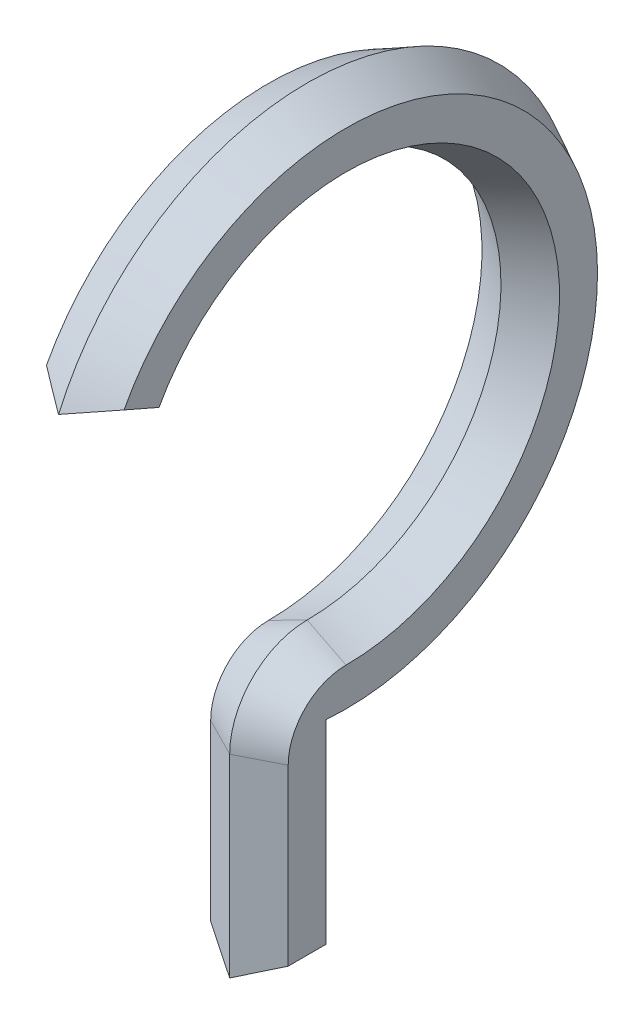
ISO-10303-21;
HEADER;
FILE_DESCRIPTION(('STEP AP214'),'2;1');
FILE_NAME('part.step','',(''),(''),'','','');
FILE_SCHEMA(('AUTOMOTIVE_DESIGN { 1 0 10303 214 1 1 1 1 }'));
ENDSEC;
DATA;
#1=APPLICATION_CONTEXT('core data for automotive mechanical design processes');
#2=APPLICATION_PROTOCOL_DEFINITION('international standard','automotive_design',2000,#1);
#3=PRODUCT_CONTEXT('',#1,'mechanical');
#4=PRODUCT('Part','Part','',(#3));
#5=PRODUCT_RELATED_PRODUCT_CATEGORY('part','',(#4));
#6=PRODUCT_DEFINITION_FORMATION('','',#4);
#7=PRODUCT_DEFINITION_CONTEXT('part definition',#1,'design');
#8=PRODUCT_DEFINITION('design','',#6,#7);
#9=PRODUCT_DEFINITION_SHAPE('','',#8);
#10=(LENGTH_UNIT() NAMED_UNIT(*) SI_UNIT(.MILLI.,.METRE.));
#11=(NAMED_UNIT(*) PLANE_ANGLE_UNIT() SI_UNIT($,.RADIAN.));
#12=(NAMED_UNIT(*) SI_UNIT($,.STERADIAN.) SOLID_ANGLE_UNIT());
#13=UNCERTAINTY_MEASURE_WITH_UNIT(LENGTH_MEASURE(1.E-05),#10,'distance_accuracy_value','');
#14=(GEOMETRIC_REPRESENTATION_CONTEXT(3) GLOBAL_UNCERTAINTY_ASSIGNED_CONTEXT((#13)) GLOBAL_UNIT_ASSIGNED_CONTEXT((#10,
#11,#12)) REPRESENTATION_CONTEXT('',''));
#15=CARTESIAN_POINT('',(0.,0.,0.));
#16=DIRECTION('',(0.,0.,1.));
#17=DIRECTION('',(1.,0.,0.));
#18=AXIS2_PLACEMENT_3D('',#15,#16,#17);
#19=CARTESIAN_POINT('',(0.,60.,-10.));
#20=DIRECTION('',(-1.,0.,0.));
#21=DIRECTION('',(0.,0.,-1.));
#22=AXIS2_PLACEMENT_3D('',#19,#20,#21);
#23=CONICAL_SURFACE('',#22,35.,0.47123889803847);
#24=CARTESIAN_POINT('',(0.,60.,-10.));
#25=DIRECTION('',(1.,0.,0.));
#26=DIRECTION('',(0.,0.,-1.));
#27=AXIS2_PLACEMENT_3D('',#24,#25,#26);
#28=CIRCLE('',#27,35.);
#29=CARTESIAN_POINT('',(0.,25.,-10.));
#30=VERTEX_POINT('',#29);
#31=CARTESIAN_POINT('',(0.,74.,22.0780298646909));
#32=VERTEX_POINT('',#31);
#33=EDGE_CURVE('E116',#30,#32,#28,.T.);
#34=ORIENTED_EDGE('',*,*,#33,.T.);
#35=CARTESIAN_POINT('',(5.,75.2758266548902,18.6322478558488));
#36=CARTESIAN_POINT('',(4.58643505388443,75.1738828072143,18.9254698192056));
#37=CARTESIAN_POINT('',(4.17202409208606,75.0707690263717,19.2170887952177));
#38=CARTESIAN_POINT('',(3.34163659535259,74.8623221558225,19.7972359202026));
#39=CARTESIAN_POINT('',(2.92566015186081,74.7569891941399,20.0857642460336));
#40=CARTESIAN_POINT('',(2.09222292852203,74.5442133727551,20.6598772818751));
#41=CARTESIAN_POINT('',(1.67476215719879,74.4367705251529,20.9454620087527));
#42=CARTESIAN_POINT('',(0.838419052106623,74.2198697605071,21.5138251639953));
#43=CARTESIAN_POINT('',(0.41953663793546,74.1104117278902,21.796603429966));
#44=CARTESIAN_POINT('',(0.,74.,22.0780298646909));
#45=B_SPLINE_CURVE_WITH_KNOTS('',3,(#35,#36,#37,#38,#39,#40,#41,#42,#43,#44),.UNSPECIFIED.,.F.,
.F.,(4,2,2,2,4),(0.,1.55133720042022,3.10258514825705,4.65382420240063,6.20515250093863),.UNSPECIFIED.);
#46=CARTESIAN_POINT('',(5.,75.2758266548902,18.6322478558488));
#47=VERTEX_POINT('',#46);
#48=EDGE_CURVE('E11',#47,#32,#45,.T.);
#49=ORIENTED_EDGE('',*,*,#48,.F.);
#50=CARTESIAN_POINT('',(5.,60.,-10.));
#51=DIRECTION('',(1.,0.,0.));
#52=DIRECTION('',(0.,0.,-1.));
#53=AXIS2_PLACEMENT_3D('',#50,#51,#52);
#54=CIRCLE('',#53,32.4523727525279);
#55=CARTESIAN_POINT('',(5.,27.6477807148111,-7.45237275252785));
#56=VERTEX_POINT('',#55);
#57=EDGE_CURVE('E162',#56,#47,#54,.T.);
#58=ORIENTED_EDGE('',*,*,#57,.F.);
#59=CARTESIAN_POINT('',(5.,27.6477807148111,-7.45237275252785));
#60=CARTESIAN_POINT('',(4.58643505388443,27.4198158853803,-7.66309461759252));
#61=CARTESIAN_POINT('',(4.17202409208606,27.193788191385,-7.87424754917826));
#62=CARTESIAN_POINT('',(3.34163659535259,26.7454533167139,-8.29735111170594));
#63=CARTESIAN_POINT('',(2.92566015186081,26.523145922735,-8.50930169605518));
#64=CARTESIAN_POINT('',(2.09222292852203,26.082072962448,-8.93395917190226));
#65=CARTESIAN_POINT('',(1.67476215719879,25.863307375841,-9.14666605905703));
#66=CARTESIAN_POINT('',(0.838419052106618,25.4291542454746,-9.57280415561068));
#67=CARTESIAN_POINT('',(0.419536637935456,25.2137668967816,-9.78623540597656));
#68=CARTESIAN_POINT('',(0.,25.,-10.));
#69=B_SPLINE_CURVE_WITH_KNOTS('',3,(#59,#60,#61,#62,#63,#64,#65,#66,#67,#68),.UNSPECIFIED.,.F.,
.F.,(4,2,2,2,4),(0.,1.55133720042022,3.10258514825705,4.65382420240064,6.20515250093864),.UNSPECIFIED.);
#70=EDGE_CURVE('E119',#56,#30,#69,.T.);
#71=ORIENTED_EDGE('',*,*,#70,.T.);
#72=EDGE_LOOP('',(#34,#49,#58,#71));
#73=FACE_BOUND('',#72,.T.);
#74=ADVANCED_FACE('F33',(#73),#23,.T.);
#75=CARTESIAN_POINT('',(0.,70.,12.9128784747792));
#76=DIRECTION('',(0.453990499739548,-0.816620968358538,0.356402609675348));
#77=DIRECTION('',(0.874015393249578,0.485898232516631,0.));
#78=AXIS2_PLACEMENT_3D('',#75,#76,#77);
#79=PLANE('',#78);
#80=DIRECTION('',(0.,0.400000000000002,0.916515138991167));
#81=VECTOR('',#80,1.);
#82=CARTESIAN_POINT('',(0.,70.,12.9128784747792));
#83=LINE('',#82,#81);
#84=CARTESIAN_POINT('',(0.,70.,12.9128784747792));
#85=VERTEX_POINT('',#84);
#86=EDGE_CURVE('E123',#85,#32,#83,.T.);
#87=ORIENTED_EDGE('',*,*,#86,.F.);
#88=CARTESIAN_POINT('',(5.,73.3067673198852,14.1205661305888));
#89=CARTESIAN_POINT('',(4.58042440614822,73.0328897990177,14.0274950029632));
#90=CARTESIAN_POINT('',(4.16149859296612,72.7586087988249,13.9326716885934));
#91=CARTESIAN_POINT('',(3.3250851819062,72.2092292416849,13.7393197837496));
#92=CARTESIAN_POINT('',(2.90759748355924,71.9341307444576,13.6407914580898));
#93=CARTESIAN_POINT('',(2.07413530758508,71.3830640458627,13.4398145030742));
#94=CARTESIAN_POINT('',(1.65816084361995,71.1070958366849,13.3373658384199));
#95=CARTESIAN_POINT('',(0.827828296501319,70.5542403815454,13.1283037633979));
#96=CARTESIAN_POINT('',(0.413470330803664,70.2773530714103,13.0216900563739));
#97=CARTESIAN_POINT('',(0.,70.,12.9128784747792));
#98=B_SPLINE_CURVE_WITH_KNOTS('',3,(#88,#89,#90,#91,#92,#93,#94,#95,#96,#97),.UNSPECIFIED.,.F.,
.F.,(4,2,2,2,4),(0.,1.528865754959,3.05762244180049,4.58639289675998,6.11527243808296),.UNSPECIFIED.);
#99=CARTESIAN_POINT('',(5.,73.3067673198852,14.1205661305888));
#100=VERTEX_POINT('',#99);
#101=EDGE_CURVE('E42',#100,#85,#98,.T.);
#102=ORIENTED_EDGE('',*,*,#101,.F.);
#103=DIRECTION('',(0.,0.400000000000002,0.916515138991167));
#104=VECTOR('',#103,1.);
#105=CARTESIAN_POINT('',(5.,72.3349389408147,11.8938275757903));
#106=LINE('',#105,#104);
#107=EDGE_CURVE('E132',#100,#47,#106,.T.);
#108=ORIENTED_EDGE('',*,*,#107,.T.);
#109=ORIENTED_EDGE('',*,*,#48,.T.);
#110=EDGE_LOOP('',(#87,#102,#108,#109));
#111=FACE_BOUND('',#110,.T.);
#112=ADVANCED_FACE('F128',(#111),#79,.T.);
#113=CARTESIAN_POINT('',(0.,60.,-10.));
#114=DIRECTION('',(1.,0.,0.));
#115=DIRECTION('',(0.,0.,-1.));
#116=AXIS2_PLACEMENT_3D('',#113,#114,#115);
#117=CONICAL_SURFACE('',#116,25.,0.47123889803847);
#118=CARTESIAN_POINT('',(0.,60.,-10.));
#119=DIRECTION('',(1.,0.,0.));
#120=DIRECTION('',(0.,0.,-1.));
#121=AXIS2_PLACEMENT_3D('',#118,#119,#120);
#122=CIRCLE('',#121,25.);
#123=CARTESIAN_POINT('',(0.,35.,-10.));
#124=VERTEX_POINT('',#123);
#125=EDGE_CURVE('E147',#124,#85,#122,.T.);
#126=ORIENTED_EDGE('',*,*,#125,.F.);
#127=DIRECTION('',(-0.891006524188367,0.453990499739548,0.));
#128=VECTOR('',#127,1.);
#129=CARTESIAN_POINT('',(0.,35.,-10.));
#130=LINE('',#129,#128);
#131=CARTESIAN_POINT('',(5.,32.4523727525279,-10.));
#132=VERTEX_POINT('',#131);
#133=EDGE_CURVE('E189',#132,#124,#130,.T.);
#134=ORIENTED_EDGE('',*,*,#133,.F.);
#135=CARTESIAN_POINT('',(5.,60.,-10.));
#136=DIRECTION('',(1.,0.,0.));
#137=DIRECTION('',(0.,0.,-1.));
#138=AXIS2_PLACEMENT_3D('',#135,#136,#137);
#139=CIRCLE('',#138,27.5476272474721);
#140=EDGE_CURVE('E397',#132,#100,#139,.T.);
#141=ORIENTED_EDGE('',*,*,#140,.T.);
#142=ORIENTED_EDGE('',*,*,#101,.T.);
#143=EDGE_LOOP('',(#126,#134,#141,#142));
#144=FACE_BOUND('',#143,.T.);
#145=ADVANCED_FACE('F178',(#144),#117,.F.);
#146=CARTESIAN_POINT('',(0.,25.,-10.));
#147=DIRECTION('',(-1.,0.,0.));
#148=DIRECTION('',(0.,0.,1.));
#149=AXIS2_PLACEMENT_3D('',#146,#147,#148);
#150=CONICAL_SURFACE('',#149,10.,0.47123889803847);
#151=CARTESIAN_POINT('',(0.,25.,-10.));
#152=DIRECTION('',(-1.,0.,0.));
#153=DIRECTION('',(0.,0.,1.));
#154=AXIS2_PLACEMENT_3D('',#151,#152,#153);
#155=CIRCLE('',#154,10.);
#156=CARTESIAN_POINT('',(0.,25.,0.));
#157=VERTEX_POINT('',#156);
#158=EDGE_CURVE('E149',#157,#124,#155,.T.);
#159=ORIENTED_EDGE('',*,*,#158,.F.);
#160=DIRECTION('',(-0.891006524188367,0.,0.453990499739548));
#161=VECTOR('',#160,1.);
#162=CARTESIAN_POINT('',(0.,25.,0.));
#163=LINE('',#162,#161);
#164=CARTESIAN_POINT('',(5.,25.,-2.54762724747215));
#165=VERTEX_POINT('',#164);
#166=EDGE_CURVE('E381',#165,#157,#163,.T.);
#167=ORIENTED_EDGE('',*,*,#166,.F.);
#168=CARTESIAN_POINT('',(5.,25.,-10.));
#169=DIRECTION('',(1.,0.,0.));
#170=DIRECTION('',(0.,0.,-1.));
#171=AXIS2_PLACEMENT_3D('',#168,#169,#170);
#172=CIRCLE('',#171,7.45237275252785);
#173=EDGE_CURVE('E393',#165,#132,#172,.F.);
#174=ORIENTED_EDGE('',*,*,#173,.T.);
#175=ORIENTED_EDGE('',*,*,#133,.T.);
#176=EDGE_LOOP('',(#159,#167,#174,#175));
#177=FACE_BOUND('',#176,.T.);
#178=ADVANCED_FACE('F35',(#177),#150,.T.);
#179=CARTESIAN_POINT('',(0.,0.,0.));
#180=DIRECTION('',(0.453990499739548,0.,0.891006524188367));
#181=DIRECTION('',(0.891006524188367,0.,-0.453990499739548));
#182=AXIS2_PLACEMENT_3D('',#179,#180,#181);
#183=PLANE('',#182);
#184=DIRECTION('',(0.,1.,0.));
#185=VECTOR('',#184,1.);
#186=CARTESIAN_POINT('',(0.,0.,0.));
#187=LINE('',#186,#185);
#188=CARTESIAN_POINT('',(0.,0.,0.));
#189=VERTEX_POINT('',#188);
#190=EDGE_CURVE('E155',#189,#157,#187,.T.);
#191=ORIENTED_EDGE('',*,*,#190,.F.);
#192=DIRECTION('',(-0.811311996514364,-0.413384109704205,0.413384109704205));
#193=VECTOR('',#192,1.);
#194=CARTESIAN_POINT('',(3.35383487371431,1.70886422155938,-1.70886422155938));
#195=LINE('',#194,#193);
#196=CARTESIAN_POINT('',(5.,2.54762724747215,-2.54762724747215));
#197=VERTEX_POINT('',#196);
#198=EDGE_CURVE('E386',#197,#189,#195,.T.);
#199=ORIENTED_EDGE('',*,*,#198,.F.);
#200=DIRECTION('',(0.,1.,0.));
#201=VECTOR('',#200,1.);
#202=CARTESIAN_POINT('',(5.,0.,-2.54762724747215));
#203=LINE('',#202,#201);
#204=EDGE_CURVE('E392',#197,#165,#203,.T.);
#205=ORIENTED_EDGE('',*,*,#204,.T.);
#206=ORIENTED_EDGE('',*,*,#166,.T.);
#207=EDGE_LOOP('',(#191,#199,#205,#206));
#208=FACE_BOUND('',#207,.T.);
#209=ADVANCED_FACE('F198',(#208),#183,.T.);
#210=CARTESIAN_POINT('',(0.,0.,-10.));
#211=DIRECTION('',(0.453990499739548,-0.891006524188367,0.));
#212=DIRECTION('',(0.891006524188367,0.453990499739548,0.));
#213=AXIS2_PLACEMENT_3D('',#210,#211,#212);
#214=PLANE('',#213);
#215=DIRECTION('',(0.,0.,1.));
#216=VECTOR('',#215,1.);
#217=CARTESIAN_POINT('',(0.,0.,-10.));
#218=LINE('',#217,#216);
#219=CARTESIAN_POINT('',(0.,0.,-10.));
#220=VERTEX_POINT('',#219);
#221=EDGE_CURVE('E158',#220,#189,#218,.T.);
#222=ORIENTED_EDGE('',*,*,#221,.F.);
#223=DIRECTION('',(0.811311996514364,0.413384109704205,0.413384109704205));
#224=VECTOR('',#223,1.);
#225=CARTESIAN_POINT('',(0.,0.,-10.));
#226=LINE('',#225,#224);
#227=CARTESIAN_POINT('',(5.,2.54762724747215,-7.45237275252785));
#228=VERTEX_POINT('',#227);
#229=EDGE_CURVE('E57',#228,#220,#226,.F.);
#230=ORIENTED_EDGE('',*,*,#229,.F.);
#231=DIRECTION('',(0.,0.,1.));
#232=VECTOR('',#231,1.);
#233=CARTESIAN_POINT('',(5.,2.54762724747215,-10.));
#234=LINE('',#233,#232);
#235=EDGE_CURVE('E390',#228,#197,#234,.T.);
#236=ORIENTED_EDGE('',*,*,#235,.T.);
#237=ORIENTED_EDGE('',*,*,#198,.T.);
#238=EDGE_LOOP('',(#222,#230,#236,#237));
#239=FACE_BOUND('',#238,.T.);
#240=ADVANCED_FACE('F196',(#239),#214,.T.);
#241=CARTESIAN_POINT('',(0.,0.,-10.));
#242=DIRECTION('',(0.453990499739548,0.,-0.891006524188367));
#243=DIRECTION('',(-0.891006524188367,0.,-0.453990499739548));
#244=AXIS2_PLACEMENT_3D('',#241,#242,#243);
#245=PLANE('',#244);
#246=DIRECTION('',(0.,1.,0.));
#247=VECTOR('',#246,1.);
#248=CARTESIAN_POINT('',(0.,0.,-10.));
#249=LINE('',#248,#247);
#250=EDGE_CURVE('E161',#220,#30,#249,.T.);
#251=ORIENTED_EDGE('',*,*,#250,.T.);
#252=ORIENTED_EDGE('',*,*,#70,.F.);
#253=DIRECTION('',(0.,-1.,0.));
#254=VECTOR('',#253,1.);
#255=CARTESIAN_POINT('',(5.,0.,-7.45237275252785));
#256=LINE('',#255,#254);
#257=EDGE_CURVE('E37',#228,#56,#256,.F.);
#258=ORIENTED_EDGE('',*,*,#257,.F.);
#259=ORIENTED_EDGE('',*,*,#229,.T.);
#260=EDGE_LOOP('',(#251,#252,#258,#259));
#261=FACE_BOUND('',#260,.T.);
#262=ADVANCED_FACE('F179',(#261),#245,.T.);
#263=CARTESIAN_POINT('',(5.,60.,-10.));
#264=DIRECTION('',(1.,0.,0.));
#265=DIRECTION('',(0.,0.,-1.));
#266=AXIS2_PLACEMENT_3D('',#263,#264,#265);
#267=PLANE('',#266);
#268=ORIENTED_EDGE('',*,*,#57,.T.);
#269=ORIENTED_EDGE('',*,*,#107,.F.);
#270=ORIENTED_EDGE('',*,*,#140,.F.);
#271=ORIENTED_EDGE('',*,*,#173,.F.);
#272=ORIENTED_EDGE('',*,*,#204,.F.);
#273=ORIENTED_EDGE('',*,*,#235,.F.);
#274=ORIENTED_EDGE('',*,*,#257,.T.);
#275=EDGE_LOOP('',(#268,#269,#270,#271,#272,#273,#274));
#276=FACE_BOUND('',#275,.T.);
#277=ADVANCED_FACE('F240',(#276),#267,.T.);
#278=CARTESIAN_POINT('',(0.,60.,-10.));
#279=DIRECTION('',(1.,0.,0.));
#280=DIRECTION('',(0.,0.,-1.));
#281=AXIS2_PLACEMENT_3D('',#278,#279,#280);
#282=CONICAL_SURFACE('',#281,35.,0.47123889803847);
#283=ORIENTED_EDGE('',*,*,#33,.F.);
#284=CARTESIAN_POINT('',(-5.,27.6477807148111,-7.45237275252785));
#285=CARTESIAN_POINT('',(-4.58643505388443,27.4198158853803,-7.66309461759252));
#286=CARTESIAN_POINT('',(-4.17202409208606,27.193788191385,-7.87424754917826));
#287=CARTESIAN_POINT('',(-3.34163659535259,26.7454533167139,-8.29735111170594));
#288=CARTESIAN_POINT('',(-2.92566015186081,26.523145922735,-8.50930169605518));
#289=CARTESIAN_POINT('',(-2.09222292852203,26.082072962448,-8.93395917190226));
#290=CARTESIAN_POINT('',(-1.67476215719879,25.863307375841,-9.14666605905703));
#291=CARTESIAN_POINT('',(-0.838419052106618,25.4291542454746,-9.57280415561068));
#292=CARTESIAN_POINT('',(-0.419536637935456,25.2137668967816,-9.78623540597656));
#293=CARTESIAN_POINT('',(0.,25.,-10.));
#294=B_SPLINE_CURVE_WITH_KNOTS('',3,(#284,#285,#286,#287,#288,#289,#290,#291,#292,#293),
.UNSPECIFIED.,.F.,.F.,(4,2,2,2,4),(0.,1.55133720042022,3.10258514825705,4.65382420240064,
6.20515250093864),.UNSPECIFIED.);
#295=CARTESIAN_POINT('',(-5.,27.6477807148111,-7.45237275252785));
#296=VERTEX_POINT('',#295);
#297=EDGE_CURVE('E124',#296,#30,#294,.T.);
#298=ORIENTED_EDGE('',*,*,#297,.F.);
#299=CARTESIAN_POINT('',(-5.,60.,-10.));
#300=DIRECTION('',(1.,0.,0.));
#301=DIRECTION('',(0.,0.,-1.));
#302=AXIS2_PLACEMENT_3D('',#299,#300,#301);
#303=CIRCLE('',#302,32.4523727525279);
#304=CARTESIAN_POINT('',(-5.,75.2758266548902,18.6322478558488));
#305=VERTEX_POINT('',#304);
#306=EDGE_CURVE('E138',#296,#305,#303,.T.);
#307=ORIENTED_EDGE('',*,*,#306,.T.);
#308=CARTESIAN_POINT('',(-5.,75.2758266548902,18.6322478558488));
#309=CARTESIAN_POINT('',(-4.58643505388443,75.1738828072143,18.9254698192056));
#310=CARTESIAN_POINT('',(-4.17202409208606,75.0707690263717,19.2170887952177));
#311=CARTESIAN_POINT('',(-3.34163659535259,74.8623221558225,19.7972359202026));
#312=CARTESIAN_POINT('',(-2.92566015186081,74.7569891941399,20.0857642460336));
#313=CARTESIAN_POINT('',(-2.09222292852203,74.5442133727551,20.6598772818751));
#314=CARTESIAN_POINT('',(-1.67476215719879,74.4367705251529,20.9454620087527));
#315=CARTESIAN_POINT('',(-0.838419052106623,74.2198697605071,21.5138251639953));
#316=CARTESIAN_POINT('',(-0.41953663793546,74.1104117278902,21.796603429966));
#317=CARTESIAN_POINT('',(0.,74.,22.0780298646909));
#318=B_SPLINE_CURVE_WITH_KNOTS('',3,(#308,#309,#310,#311,#312,#313,#314,#315,#316,#317),
.UNSPECIFIED.,.F.,.F.,(4,2,2,2,4),(0.,1.55133720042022,3.10258514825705,4.65382420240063,
6.20515250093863),.UNSPECIFIED.);
#319=EDGE_CURVE('E135',#305,#32,#318,.T.);
#320=ORIENTED_EDGE('',*,*,#319,.T.);
#321=EDGE_LOOP('',(#283,#298,#307,#320));
#322=FACE_BOUND('',#321,.T.);
#323=ADVANCED_FACE('F136',(#322),#282,.T.);
#324=CARTESIAN_POINT('',(0.,0.,-10.));
#325=DIRECTION('',(-0.453990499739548,0.,-0.891006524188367));
#326=DIRECTION('',(-0.891006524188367,0.,0.453990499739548));
#327=AXIS2_PLACEMENT_3D('',#324,#325,#326);
#328=PLANE('',#327);
#329=ORIENTED_EDGE('',*,*,#250,.F.);
#330=DIRECTION('',(-0.811311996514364,0.413384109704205,0.413384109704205));
#331=VECTOR('',#330,1.);
#332=CARTESIAN_POINT('',(0.,0.,-10.));
#333=LINE('',#332,#331);
#334=CARTESIAN_POINT('',(-5.,2.54762724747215,-7.45237275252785));
#335=VERTEX_POINT('',#334);
#336=EDGE_CURVE('E357',#335,#220,#333,.F.);
#337=ORIENTED_EDGE('',*,*,#336,.F.);
#338=DIRECTION('',(0.,1.,0.));
#339=VECTOR('',#338,1.);
#340=CARTESIAN_POINT('',(-5.,60.,-7.45237275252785));
#341=LINE('',#340,#339);
#342=EDGE_CURVE('E142',#335,#296,#341,.T.);
#343=ORIENTED_EDGE('',*,*,#342,.T.);
#344=ORIENTED_EDGE('',*,*,#297,.T.);
#345=EDGE_LOOP('',(#329,#337,#343,#344));
#346=FACE_BOUND('',#345,.T.);
#347=ADVANCED_FACE('F256',(#346),#328,.T.);
#348=CARTESIAN_POINT('',(0.,0.,-10.));
#349=DIRECTION('',(-0.453990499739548,-0.891006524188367,0.));
#350=DIRECTION('',(0.891006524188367,-0.453990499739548,0.));
#351=AXIS2_PLACEMENT_3D('',#348,#349,#350);
#352=PLANE('',#351);
#353=ORIENTED_EDGE('',*,*,#221,.T.);
#354=DIRECTION('',(0.811311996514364,-0.413384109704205,0.413384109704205));
#355=VECTOR('',#354,1.);
#356=CARTESIAN_POINT('',(0.,0.,0.));
#357=LINE('',#356,#355);
#358=CARTESIAN_POINT('',(-5.,2.54762724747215,-2.54762724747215));
#359=VERTEX_POINT('',#358);
#360=EDGE_CURVE('E354',#359,#189,#357,.T.);
#361=ORIENTED_EDGE('',*,*,#360,.F.);
#362=DIRECTION('',(0.,0.,-1.));
#363=VECTOR('',#362,1.);
#364=CARTESIAN_POINT('',(-5.,2.54762724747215,-10.));
#365=LINE('',#364,#363);
#366=EDGE_CURVE('E364',#335,#359,#365,.F.);
#367=ORIENTED_EDGE('',*,*,#366,.F.);
#368=ORIENTED_EDGE('',*,*,#336,.T.);
#369=EDGE_LOOP('',(#353,#361,#367,#368));
#370=FACE_BOUND('',#369,.T.);
#371=ADVANCED_FACE('F265',(#370),#352,.T.);
#372=CARTESIAN_POINT('',(0.,0.,0.));
#373=DIRECTION('',(-0.453990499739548,0.,0.891006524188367));
#374=DIRECTION('',(0.891006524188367,0.,0.453990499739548));
#375=AXIS2_PLACEMENT_3D('',#372,#373,#374);
#376=PLANE('',#375);
#377=ORIENTED_EDGE('',*,*,#190,.T.);
#378=DIRECTION('',(0.891006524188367,0.,0.453990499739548));
#379=VECTOR('',#378,1.);
#380=CARTESIAN_POINT('',(0.,25.,0.));
#381=LINE('',#380,#379);
#382=CARTESIAN_POINT('',(-5.,25.,-2.54762724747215));
#383=VERTEX_POINT('',#382);
#384=EDGE_CURVE('E351',#383,#157,#381,.T.);
#385=ORIENTED_EDGE('',*,*,#384,.F.);
#386=DIRECTION('',(0.,-1.,0.));
#387=VECTOR('',#386,1.);
#388=CARTESIAN_POINT('',(-5.,60.,-2.54762724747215));
#389=LINE('',#388,#387);
#390=EDGE_CURVE('E366',#359,#383,#389,.F.);
#391=ORIENTED_EDGE('',*,*,#390,.F.);
#392=ORIENTED_EDGE('',*,*,#360,.T.);
#393=EDGE_LOOP('',(#377,#385,#391,#392));
#394=FACE_BOUND('',#393,.T.);
#395=ADVANCED_FACE('F275',(#394),#376,.T.);
#396=CARTESIAN_POINT('',(0.,25.,-10.));
#397=DIRECTION('',(1.,0.,0.));
#398=DIRECTION('',(0.,0.,1.));
#399=AXIS2_PLACEMENT_3D('',#396,#397,#398);
#400=CONICAL_SURFACE('',#399,10.,0.47123889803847);
#401=ORIENTED_EDGE('',*,*,#158,.T.);
#402=DIRECTION('',(0.891006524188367,0.453990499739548,0.));
#403=VECTOR('',#402,1.);
#404=CARTESIAN_POINT('',(0.,35.,-10.));
#405=LINE('',#404,#403);
#406=CARTESIAN_POINT('',(-5.,32.4523727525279,-10.));
#407=VERTEX_POINT('',#406);
#408=EDGE_CURVE('E348',#407,#124,#405,.T.);
#409=ORIENTED_EDGE('',*,*,#408,.F.);
#410=CARTESIAN_POINT('',(-5.,25.,-10.));
#411=DIRECTION('',(1.,0.,0.));
#412=DIRECTION('',(0.,0.,-1.));
#413=AXIS2_PLACEMENT_3D('',#410,#411,#412);
#414=CIRCLE('',#413,7.45237275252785);
#415=EDGE_CURVE('E368',#383,#407,#414,.F.);
#416=ORIENTED_EDGE('',*,*,#415,.F.);
#417=ORIENTED_EDGE('',*,*,#384,.T.);
#418=EDGE_LOOP('',(#401,#409,#416,#417));
#419=FACE_BOUND('',#418,.T.);
#420=ADVANCED_FACE('F286',(#419),#400,.T.);
#421=CARTESIAN_POINT('',(0.,60.,-10.));
#422=DIRECTION('',(-1.,0.,0.));
#423=DIRECTION('',(0.,0.,-1.));
#424=AXIS2_PLACEMENT_3D('',#421,#422,#423);
#425=CONICAL_SURFACE('',#424,25.,0.47123889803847);
#426=ORIENTED_EDGE('',*,*,#125,.T.);
#427=CARTESIAN_POINT('',(-5.,73.3067673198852,14.1205661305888));
#428=CARTESIAN_POINT('',(-4.58042440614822,73.0328897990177,14.0274950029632));
#429=CARTESIAN_POINT('',(-4.16149859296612,72.7586087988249,13.9326716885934));
#430=CARTESIAN_POINT('',(-3.3250851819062,72.2092292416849,13.7393197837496));
#431=CARTESIAN_POINT('',(-2.90759748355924,71.9341307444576,13.6407914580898));
#432=CARTESIAN_POINT('',(-2.07413530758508,71.3830640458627,13.4398145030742));
#433=CARTESIAN_POINT('',(-1.65816084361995,71.1070958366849,13.3373658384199));
#434=CARTESIAN_POINT('',(-0.827828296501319,70.5542403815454,13.1283037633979));
#435=CARTESIAN_POINT('',(-0.413470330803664,70.2773530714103,13.0216900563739));
#436=CARTESIAN_POINT('',(0.,70.,12.9128784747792));
#437=B_SPLINE_CURVE_WITH_KNOTS('',3,(#427,#428,#429,#430,#431,#432,#433,#434,#435,#436),
.UNSPECIFIED.,.F.,.F.,(4,2,2,2,4),(0.,1.528865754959,3.05762244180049,4.58639289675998,
6.11527243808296),.UNSPECIFIED.);
#438=CARTESIAN_POINT('',(-5.,73.3067673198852,14.1205661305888));
#439=VERTEX_POINT('',#438);
#440=EDGE_CURVE('E141',#439,#85,#437,.T.);
#441=ORIENTED_EDGE('',*,*,#440,.F.);
#442=CARTESIAN_POINT('',(-5.,60.,-10.));
#443=DIRECTION('',(1.,0.,0.));
#444=DIRECTION('',(0.,0.,-1.));
#445=AXIS2_PLACEMENT_3D('',#442,#443,#444);
#446=CIRCLE('',#445,27.5476272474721);
#447=EDGE_CURVE('E370',#407,#439,#446,.T.);
#448=ORIENTED_EDGE('',*,*,#447,.F.);
#449=ORIENTED_EDGE('',*,*,#408,.T.);
#450=EDGE_LOOP('',(#426,#441,#448,#449));
#451=FACE_BOUND('',#450,.T.);
#452=ADVANCED_FACE('F297',(#451),#425,.F.);
#453=CARTESIAN_POINT('',(0.,70.,12.9128784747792));
#454=DIRECTION('',(-0.453990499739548,-0.816620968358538,0.356402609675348));
#455=DIRECTION('',(0.874015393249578,-0.485898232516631,0.));
#456=AXIS2_PLACEMENT_3D('',#453,#454,#455);
#457=PLANE('',#456);
#458=ORIENTED_EDGE('',*,*,#86,.T.);
#459=ORIENTED_EDGE('',*,*,#319,.F.);
#460=DIRECTION('',(0.,-0.400000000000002,-0.916515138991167));
#461=VECTOR('',#460,1.);
#462=CARTESIAN_POINT('',(-5.,62.3349389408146,-11.0190508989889));
#463=LINE('',#462,#461);
#464=EDGE_CURVE('E361',#439,#305,#463,.F.);
#465=ORIENTED_EDGE('',*,*,#464,.F.);
#466=ORIENTED_EDGE('',*,*,#440,.T.);
#467=EDGE_LOOP('',(#458,#459,#465,#466));
#468=FACE_BOUND('',#467,.T.);
#469=ADVANCED_FACE('F145',(#468),#457,.T.);
#470=CARTESIAN_POINT('',(-5.,60.,-10.));
#471=DIRECTION('',(1.,0.,0.));
#472=DIRECTION('',(0.,0.,-1.));
#473=AXIS2_PLACEMENT_3D('',#470,#471,#472);
#474=PLANE('',#473);
#475=ORIENTED_EDGE('',*,*,#306,.F.);
#476=ORIENTED_EDGE('',*,*,#342,.F.);
#477=ORIENTED_EDGE('',*,*,#366,.T.);
#478=ORIENTED_EDGE('',*,*,#390,.T.);
#479=ORIENTED_EDGE('',*,*,#415,.T.);
#480=ORIENTED_EDGE('',*,*,#447,.T.);
#481=ORIENTED_EDGE('',*,*,#464,.T.);
#482=EDGE_LOOP('',(#475,#476,#477,#478,#479,#480,#481));
#483=FACE_BOUND('',#482,.T.);
#484=ADVANCED_FACE('F317',(#483),#474,.F.);
#485=CLOSED_SHELL('',(#74,#112,#145,#178,#209,#240,#262,#277,#323,#347,#371,#395,#420,#452,#469,#484));
#486=MANIFOLD_SOLID_BREP('B2',#485);
#487=ADVANCED_BREP_SHAPE_REPRESENTATION('',(#18,#486),#14);
#488=SHAPE_DEFINITION_REPRESENTATION(#9,#487);
ENDSEC;
END-ISO-10303-21;
